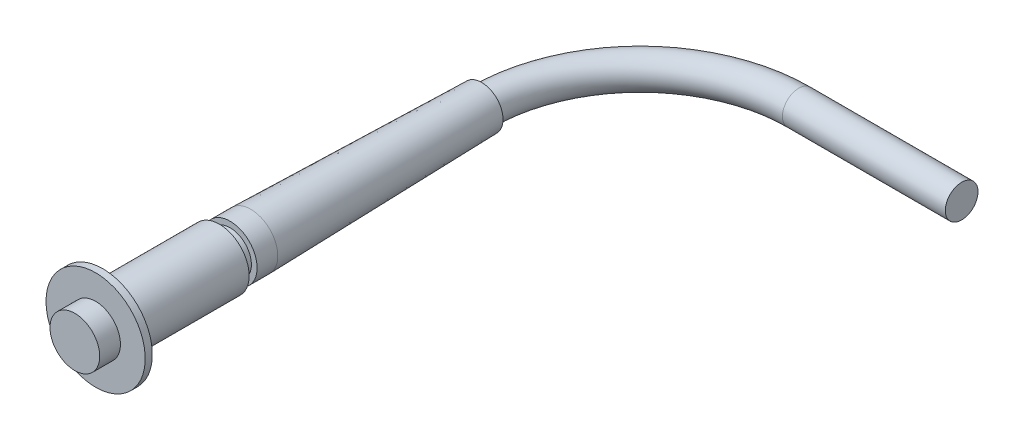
ISO-10303-21;
HEADER;
FILE_DESCRIPTION(('STEP AP214'),'2;1');
FILE_NAME('part.step','',(''),(''),'','','');
FILE_SCHEMA(('AUTOMOTIVE_DESIGN { 1 0 10303 214 1 1 1 1 }'));
ENDSEC;
DATA;
#1=APPLICATION_CONTEXT('core data for automotive mechanical design processes');
#2=APPLICATION_PROTOCOL_DEFINITION('international standard','automotive_design',2000,#1);
#3=PRODUCT_CONTEXT('',#1,'mechanical');
#4=PRODUCT('Part','Part','',(#3));
#5=PRODUCT_RELATED_PRODUCT_CATEGORY('part','',(#4));
#6=PRODUCT_DEFINITION_FORMATION('','',#4);
#7=PRODUCT_DEFINITION_CONTEXT('part definition',#1,'design');
#8=PRODUCT_DEFINITION('design','',#6,#7);
#9=PRODUCT_DEFINITION_SHAPE('','',#8);
#10=(LENGTH_UNIT() NAMED_UNIT(*) SI_UNIT(.MILLI.,.METRE.));
#11=(NAMED_UNIT(*) PLANE_ANGLE_UNIT() SI_UNIT($,.RADIAN.));
#12=(NAMED_UNIT(*) SI_UNIT($,.STERADIAN.) SOLID_ANGLE_UNIT());
#13=UNCERTAINTY_MEASURE_WITH_UNIT(LENGTH_MEASURE(1.E-05),#10,'distance_accuracy_value','');
#14=(GEOMETRIC_REPRESENTATION_CONTEXT(3) GLOBAL_UNCERTAINTY_ASSIGNED_CONTEXT((#13)) GLOBAL_UNIT_ASSIGNED_CONTEXT((#10,
#11,#12)) REPRESENTATION_CONTEXT('',''));
#15=CARTESIAN_POINT('',(0.,0.,0.));
#16=DIRECTION('',(0.,0.,1.));
#17=DIRECTION('',(1.,0.,0.));
#18=AXIS2_PLACEMENT_3D('',#15,#16,#17);
#19=CARTESIAN_POINT('',(0.,0.,18.542));
#20=DIRECTION('',(0.,0.,1.));
#21=DIRECTION('',(1.,0.,0.));
#22=AXIS2_PLACEMENT_3D('',#19,#20,#21);
#23=PLANE('',#22);
#24=CARTESIAN_POINT('',(0.,0.,18.542));
#25=DIRECTION('',(0.,0.,-1.));
#26=DIRECTION('',(-1.,0.,0.));
#27=AXIS2_PLACEMENT_3D('',#24,#25,#26);
#28=CIRCLE('',#27,22.1996);
#29=CARTESIAN_POINT('',(-22.1996,0.,18.542));
#30=VERTEX_POINT('',#29);
#31=EDGE_CURVE('E375',#30,#30,#28,.T.);
#32=ORIENTED_EDGE('',*,*,#31,.F.);
#33=EDGE_LOOP('',(#32));
#34=FACE_BOUND('',#33,.T.);
#35=ADVANCED_FACE('F372',(#34),#23,.T.);
#36=CARTESIAN_POINT('',(0.,0.,-204.828193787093));
#37=DIRECTION('',(0.,0.,-1.));
#38=DIRECTION('',(-1.,0.,0.));
#39=AXIS2_PLACEMENT_3D('',#36,#37,#38);
#40=CYLINDRICAL_SURFACE('',#39,22.1996);
#41=ORIENTED_EDGE('',*,*,#31,.T.);
#42=EDGE_LOOP('',(#41));
#43=FACE_BOUND('',#42,.T.);
#44=CARTESIAN_POINT('',(0.,0.,0.));
#45=DIRECTION('',(0.,0.,-1.));
#46=DIRECTION('',(-1.,0.,0.));
#47=AXIS2_PLACEMENT_3D('',#44,#45,#46);
#48=CIRCLE('',#47,22.1996);
#49=CARTESIAN_POINT('',(-22.1996,0.,0.));
#50=VERTEX_POINT('',#49);
#51=EDGE_CURVE('E383',#50,#50,#48,.T.);
#52=ORIENTED_EDGE('',*,*,#51,.F.);
#53=EDGE_LOOP('',(#52));
#54=FACE_BOUND('',#53,.T.);
#55=ADVANCED_FACE('F423',(#43,#54),#40,.T.);
#56=CARTESIAN_POINT('',(-22.1996,0.,0.));
#57=DIRECTION('',(0.,0.,1.));
#58=DIRECTION('',(1.,0.,0.));
#59=AXIS2_PLACEMENT_3D('',#56,#57,#58);
#60=PLANE('',#59);
#61=ORIENTED_EDGE('',*,*,#51,.T.);
#62=EDGE_LOOP('',(#61));
#63=FACE_BOUND('',#62,.T.);
#64=CARTESIAN_POINT('',(0.,0.,0.));
#65=DIRECTION('',(0.,0.,-1.));
#66=DIRECTION('',(-1.,0.,0.));
#67=AXIS2_PLACEMENT_3D('',#64,#65,#66);
#68=CIRCLE('',#67,44.323);
#69=CARTESIAN_POINT('',(-44.323,0.,0.));
#70=VERTEX_POINT('',#69);
#71=EDGE_CURVE('E415',#70,#70,#68,.T.);
#72=ORIENTED_EDGE('',*,*,#71,.F.);
#73=EDGE_LOOP('',(#72));
#74=FACE_BOUND('',#73,.T.);
#75=ADVANCED_FACE('F420',(#63,#74),#60,.T.);
#76=CARTESIAN_POINT('',(0.,0.,-204.828193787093));
#77=DIRECTION('',(0.,0.,-1.));
#78=DIRECTION('',(-1.,0.,0.));
#79=AXIS2_PLACEMENT_3D('',#76,#77,#78);
#80=CYLINDRICAL_SURFACE('',#79,44.323);
#81=ORIENTED_EDGE('',*,*,#71,.T.);
#82=EDGE_LOOP('',(#81));
#83=FACE_BOUND('',#82,.T.);
#84=CARTESIAN_POINT('',(0.,0.,-6.34999999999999));
#85=DIRECTION('',(0.,0.,-1.));
#86=DIRECTION('',(-1.,0.,0.));
#87=AXIS2_PLACEMENT_3D('',#84,#85,#86);
#88=CIRCLE('',#87,44.323);
#89=CARTESIAN_POINT('',(-44.323,0.,-6.34999999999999));
#90=VERTEX_POINT('',#89);
#91=EDGE_CURVE('E412',#90,#90,#88,.T.);
#92=ORIENTED_EDGE('',*,*,#91,.F.);
#93=EDGE_LOOP('',(#92));
#94=FACE_BOUND('',#93,.T.);
#95=ADVANCED_FACE('F430',(#83,#94),#80,.T.);
#96=CARTESIAN_POINT('',(-44.323,0.,-6.35));
#97=DIRECTION('',(0.,0.,-1.));
#98=DIRECTION('',(-1.,0.,0.));
#99=AXIS2_PLACEMENT_3D('',#96,#97,#98);
#100=PLANE('',#99);
#101=ORIENTED_EDGE('',*,*,#91,.T.);
#102=EDGE_LOOP('',(#101));
#103=FACE_BOUND('',#102,.T.);
#104=CARTESIAN_POINT('',(0.,0.,-6.34999999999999));
#105=DIRECTION('',(0.,0.,-1.));
#106=DIRECTION('',(-1.,0.,0.));
#107=AXIS2_PLACEMENT_3D('',#104,#105,#106);
#108=CIRCLE('',#107,26.67);
#109=CARTESIAN_POINT('',(-26.67,0.,-6.34999999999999));
#110=VERTEX_POINT('',#109);
#111=EDGE_CURVE('E409',#110,#110,#108,.T.);
#112=ORIENTED_EDGE('',*,*,#111,.F.);
#113=EDGE_LOOP('',(#112));
#114=FACE_BOUND('',#113,.T.);
#115=ADVANCED_FACE('F436',(#103,#114),#100,.T.);
#116=CARTESIAN_POINT('',(0.,0.,-204.828193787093));
#117=DIRECTION('',(0.,0.,-1.));
#118=DIRECTION('',(-1.,0.,0.));
#119=AXIS2_PLACEMENT_3D('',#116,#117,#118);
#120=CYLINDRICAL_SURFACE('',#119,26.67);
#121=ORIENTED_EDGE('',*,*,#111,.T.);
#122=EDGE_LOOP('',(#121));
#123=FACE_BOUND('',#122,.T.);
#124=CARTESIAN_POINT('',(0.,0.,-110.49));
#125=DIRECTION('',(0.,0.,-1.));
#126=DIRECTION('',(-1.,0.,0.));
#127=AXIS2_PLACEMENT_3D('',#124,#125,#126);
#128=CIRCLE('',#127,26.67);
#129=CARTESIAN_POINT('',(-26.67,0.,-110.49));
#130=VERTEX_POINT('',#129);
#131=EDGE_CURVE('E406',#130,#130,#128,.T.);
#132=ORIENTED_EDGE('',*,*,#131,.F.);
#133=EDGE_LOOP('',(#132));
#134=FACE_BOUND('',#133,.T.);
#135=ADVANCED_FACE('F440',(#123,#134),#120,.T.);
#136=CARTESIAN_POINT('',(-19.05,0.,-110.49));
#137=DIRECTION('',(0.,0.,-1.));
#138=DIRECTION('',(-1.,0.,0.));
#139=AXIS2_PLACEMENT_3D('',#136,#137,#138);
#140=PLANE('',#139);
#141=ORIENTED_EDGE('',*,*,#131,.T.);
#142=EDGE_LOOP('',(#141));
#143=FACE_BOUND('',#142,.T.);
#144=CARTESIAN_POINT('',(0.,0.,-110.49));
#145=DIRECTION('',(0.,0.,-1.));
#146=DIRECTION('',(-1.,0.,0.));
#147=AXIS2_PLACEMENT_3D('',#144,#145,#146);
#148=CIRCLE('',#147,19.05);
#149=CARTESIAN_POINT('',(-19.05,0.,-110.49));
#150=VERTEX_POINT('',#149);
#151=EDGE_CURVE('E403',#150,#150,#148,.T.);
#152=ORIENTED_EDGE('',*,*,#151,.F.);
#153=EDGE_LOOP('',(#152));
#154=FACE_BOUND('',#153,.T.);
#155=ADVANCED_FACE('F444',(#143,#154),#140,.T.);
#156=CARTESIAN_POINT('',(0.,0.,-204.828193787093));
#157=DIRECTION('',(0.,0.,-1.));
#158=DIRECTION('',(-1.,0.,0.));
#159=AXIS2_PLACEMENT_3D('',#156,#157,#158);
#160=CYLINDRICAL_SURFACE('',#159,19.05);
#161=ORIENTED_EDGE('',*,*,#151,.T.);
#162=EDGE_LOOP('',(#161));
#163=FACE_BOUND('',#162,.T.);
#164=CARTESIAN_POINT('',(0.,0.,-120.142));
#165=DIRECTION('',(0.,0.,-1.));
#166=DIRECTION('',(-1.,0.,0.));
#167=AXIS2_PLACEMENT_3D('',#164,#165,#166);
#168=CIRCLE('',#167,19.05);
#169=CARTESIAN_POINT('',(-19.05,0.,-120.142));
#170=VERTEX_POINT('',#169);
#171=EDGE_CURVE('E400',#170,#170,#168,.T.);
#172=ORIENTED_EDGE('',*,*,#171,.F.);
#173=EDGE_LOOP('',(#172));
#174=FACE_BOUND('',#173,.T.);
#175=ADVANCED_FACE('F448',(#163,#174),#160,.T.);
#176=CARTESIAN_POINT('',(-19.05,0.,-120.142));
#177=DIRECTION('',(0.,0.,1.));
#178=DIRECTION('',(1.,0.,0.));
#179=AXIS2_PLACEMENT_3D('',#176,#177,#178);
#180=PLANE('',#179);
#181=ORIENTED_EDGE('',*,*,#171,.T.);
#182=EDGE_LOOP('',(#181));
#183=FACE_BOUND('',#182,.T.);
#184=CARTESIAN_POINT('',(0.,0.,-120.142));
#185=DIRECTION('',(0.,0.,-1.));
#186=DIRECTION('',(-1.,0.,0.));
#187=AXIS2_PLACEMENT_3D('',#184,#185,#186);
#188=CIRCLE('',#187,24.13);
#189=CARTESIAN_POINT('',(-24.13,0.,-120.142));
#190=VERTEX_POINT('',#189);
#191=EDGE_CURVE('E397',#190,#190,#188,.T.);
#192=ORIENTED_EDGE('',*,*,#191,.F.);
#193=EDGE_LOOP('',(#192));
#194=FACE_BOUND('',#193,.T.);
#195=ADVANCED_FACE('F452',(#183,#194),#180,.T.);
#196=CARTESIAN_POINT('',(0.,0.,-204.828193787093));
#197=DIRECTION('',(0.,0.,-1.));
#198=DIRECTION('',(-1.,0.,0.));
#199=AXIS2_PLACEMENT_3D('',#196,#197,#198);
#200=CYLINDRICAL_SURFACE('',#199,24.13);
#201=ORIENTED_EDGE('',*,*,#191,.T.);
#202=EDGE_LOOP('',(#201));
#203=FACE_BOUND('',#202,.T.);
#204=CARTESIAN_POINT('',(0.,0.,-138.610224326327));
#205=DIRECTION('',(0.,0.,-1.));
#206=DIRECTION('',(-1.,0.,0.));
#207=AXIS2_PLACEMENT_3D('',#204,#205,#206);
#208=CIRCLE('',#207,24.13);
#209=CARTESIAN_POINT('',(-24.13,0.,-138.610224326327));
#210=VERTEX_POINT('',#209);
#211=EDGE_CURVE('E394',#210,#210,#208,.T.);
#212=ORIENTED_EDGE('',*,*,#211,.F.);
#213=EDGE_LOOP('',(#212));
#214=FACE_BOUND('',#213,.T.);
#215=ADVANCED_FACE('F456',(#203,#214),#200,.T.);
#216=CARTESIAN_POINT('',(0.,0.,-344.932));
#217=DIRECTION('',(0.,0.,1.));
#218=DIRECTION('',(1.,0.,0.));
#219=AXIS2_PLACEMENT_3D('',#216,#217,#218);
#220=CONICAL_SURFACE('',#219,19.05,0.0246167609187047);
#221=ORIENTED_EDGE('',*,*,#211,.T.);
#222=EDGE_LOOP('',(#221));
#223=FACE_BOUND('',#222,.T.);
#224=CARTESIAN_POINT('',(0.,0.,-344.932));
#225=DIRECTION('',(0.,0.,-1.));
#226=DIRECTION('',(-1.,0.,0.));
#227=AXIS2_PLACEMENT_3D('',#224,#225,#226);
#228=CIRCLE('',#227,19.05);
#229=CARTESIAN_POINT('',(-19.05,0.,-344.932));
#230=VERTEX_POINT('',#229);
#231=EDGE_CURVE('E391',#230,#230,#228,.T.);
#232=ORIENTED_EDGE('',*,*,#231,.F.);
#233=EDGE_LOOP('',(#232));
#234=FACE_BOUND('',#233,.T.);
#235=ADVANCED_FACE('F460',(#223,#234),#220,.T.);
#236=CARTESIAN_POINT('',(-19.05,0.,-344.932));
#237=DIRECTION('',(0.,0.,-1.));
#238=DIRECTION('',(-1.,0.,0.));
#239=AXIS2_PLACEMENT_3D('',#236,#237,#238);
#240=PLANE('',#239);
#241=CARTESIAN_POINT('',(0.,0.,-344.932));
#242=DIRECTION('',(0.,0.,-1.));
#243=DIRECTION('',(-1.,0.,0.));
#244=AXIS2_PLACEMENT_3D('',#241,#242,#243);
#245=CIRCLE('',#244,14.605);
#246=CARTESIAN_POINT('',(-14.605,0.,-344.932));
#247=VERTEX_POINT('',#246);
#248=EDGE_CURVE('E10',#247,#247,#245,.T.);
#249=ORIENTED_EDGE('',*,*,#248,.F.);
#250=EDGE_LOOP('',(#249));
#251=FACE_BOUND('',#250,.T.);
#252=ORIENTED_EDGE('',*,*,#231,.T.);
#253=EDGE_LOOP('',(#252));
#254=FACE_BOUND('',#253,.T.);
#255=ADVANCED_FACE('F464',(#251,#254),#240,.T.);
#256=CARTESIAN_POINT('',(141.605,0.,-486.537));
#257=DIRECTION('',(1.,0.,0.));
#258=DIRECTION('',(0.,0.,-1.));
#259=AXIS2_PLACEMENT_3D('',#256,#257,#258);
#260=CYLINDRICAL_SURFACE('',#259,14.605);
#261=CARTESIAN_POINT('',(141.605,0.,-486.537));
#262=DIRECTION('',(1.,0.,0.));
#263=DIRECTION('',(0.,0.,-1.));
#264=AXIS2_PLACEMENT_3D('',#261,#262,#263);
#265=CIRCLE('',#264,14.605);
#266=CARTESIAN_POINT('',(141.605,0.,-501.142));
#267=VERTEX_POINT('',#266);
#268=EDGE_CURVE('E385',#267,#267,#265,.T.);
#269=ORIENTED_EDGE('',*,*,#268,.T.);
#270=EDGE_LOOP('',(#269));
#271=FACE_BOUND('',#270,.T.);
#272=CARTESIAN_POINT('',(287.148986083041,0.,-486.537));
#273=DIRECTION('',(1.,0.,0.));
#274=DIRECTION('',(0.,0.,-1.));
#275=AXIS2_PLACEMENT_3D('',#272,#273,#274);
#276=CIRCLE('',#275,14.605);
#277=CARTESIAN_POINT('',(287.148986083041,0.,-501.142));
#278=VERTEX_POINT('',#277);
#279=EDGE_CURVE('E388',#278,#278,#276,.T.);
#280=ORIENTED_EDGE('',*,*,#279,.F.);
#281=EDGE_LOOP('',(#280));
#282=FACE_BOUND('',#281,.T.);
#283=ADVANCED_FACE('F468',(#271,#282),#260,.T.);
#284=CARTESIAN_POINT('',(141.605,0.,-344.932));
#285=DIRECTION('',(0.,1.,0.));
#286=DIRECTION('',(0.,0.,1.));
#287=AXIS2_PLACEMENT_3D('',#284,#285,#286);
#288=TOROIDAL_SURFACE('',#287,141.605,14.605);
#289=CARTESIAN_POINT('',(141.605,0.,-344.932));
#290=DIRECTION('',(0.,1.,0.));
#291=DIRECTION('',(0.,0.,1.));
#292=AXIS2_PLACEMENT_3D('',#289,#290,#291);
#293=CIRCLE('',#292,156.21);
#294=EDGE_CURVE('',#267,#247,#293,.T.);
#295=ORIENTED_EDGE('',*,*,#268,.F.);
#296=ORIENTED_EDGE('',*,*,#248,.T.);
#297=ORIENTED_EDGE('',*,*,#294,.T.);
#298=ORIENTED_EDGE('',*,*,#294,.F.);
#299=EDGE_LOOP('',(#295,#297,#296,#298));
#300=FACE_BOUND('',#299,.T.);
#301=ADVANCED_FACE('F472',(#300),#288,.T.);
#302=CARTESIAN_POINT('',(287.148986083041,0.,-486.537));
#303=DIRECTION('',(1.,0.,0.));
#304=DIRECTION('',(0.,0.,-1.));
#305=AXIS2_PLACEMENT_3D('',#302,#303,#304);
#306=PLANE('',#305);
#307=ORIENTED_EDGE('',*,*,#279,.T.);
#308=EDGE_LOOP('',(#307));
#309=FACE_BOUND('',#308,.T.);
#310=ADVANCED_FACE('F474',(#309),#306,.T.);
#311=CLOSED_SHELL('',(#35,#55,#75,#95,#115,#135,#155,#175,#195,#215,#235,#255,#283,#301,#310));
#312=MANIFOLD_SOLID_BREP('B2',#311);
#313=ADVANCED_BREP_SHAPE_REPRESENTATION('',(#18,#312),#14);
#314=SHAPE_DEFINITION_REPRESENTATION(#9,#313);
ENDSEC;
END-ISO-10303-21;
